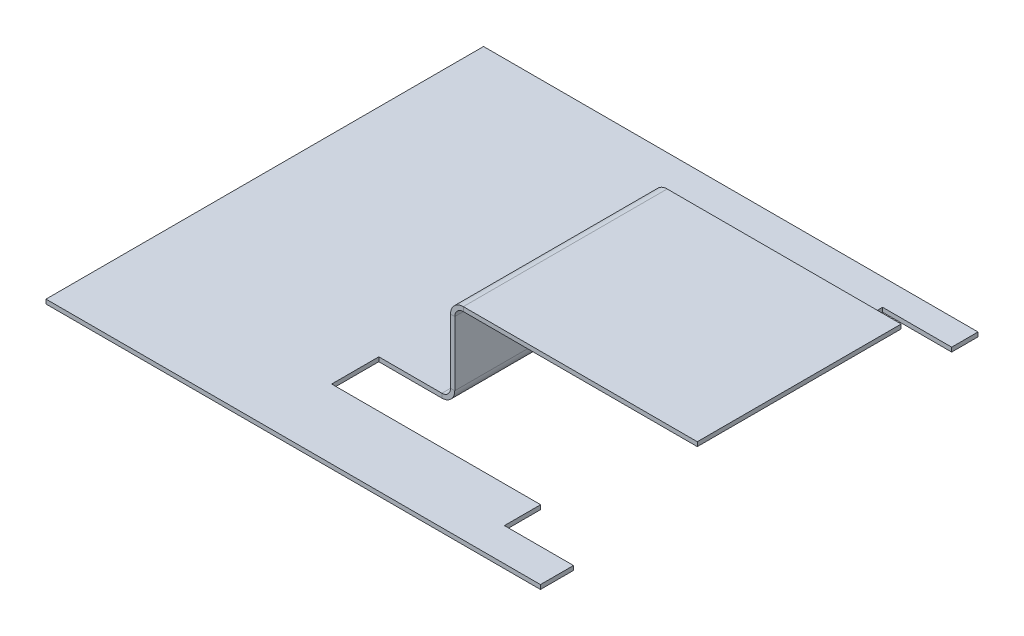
ISO-10303-21;
HEADER;
FILE_DESCRIPTION(('STEP AP214'),'2;1');
FILE_NAME('part.step','',(''),(''),'','','');
FILE_SCHEMA(('AUTOMOTIVE_DESIGN { 1 0 10303 214 1 1 1 1 }'));
ENDSEC;
DATA;
#1=APPLICATION_CONTEXT('core data for automotive mechanical design processes');
#2=APPLICATION_PROTOCOL_DEFINITION('international standard','automotive_design',2000,#1);
#3=PRODUCT_CONTEXT('',#1,'mechanical');
#4=PRODUCT('Part','Part','',(#3));
#5=PRODUCT_RELATED_PRODUCT_CATEGORY('part','',(#4));
#6=PRODUCT_DEFINITION_FORMATION('','',#4);
#7=PRODUCT_DEFINITION_CONTEXT('part definition',#1,'design');
#8=PRODUCT_DEFINITION('design','',#6,#7);
#9=PRODUCT_DEFINITION_SHAPE('','',#8);
#10=(LENGTH_UNIT() NAMED_UNIT(*) SI_UNIT(.MILLI.,.METRE.));
#11=(NAMED_UNIT(*) PLANE_ANGLE_UNIT() SI_UNIT($,.RADIAN.));
#12=(NAMED_UNIT(*) SI_UNIT($,.STERADIAN.) SOLID_ANGLE_UNIT());
#13=UNCERTAINTY_MEASURE_WITH_UNIT(LENGTH_MEASURE(1.E-05),#10,'distance_accuracy_value','');
#14=(GEOMETRIC_REPRESENTATION_CONTEXT(3) GLOBAL_UNCERTAINTY_ASSIGNED_CONTEXT((#13)) GLOBAL_UNIT_ASSIGNED_CONTEXT((#10,
#11,#12)) REPRESENTATION_CONTEXT('',''));
#15=CARTESIAN_POINT('',(0.,0.,0.));
#16=DIRECTION('',(0.,0.,1.));
#17=DIRECTION('',(1.,0.,0.));
#18=AXIS2_PLACEMENT_3D('',#15,#16,#17);
#19=CARTESIAN_POINT('',(57.78914352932,49.2432345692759,41.4697311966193));
#20=DIRECTION('',(1.,0.,0.));
#21=DIRECTION('',(0.,0.,-1.));
#22=AXIS2_PLACEMENT_3D('',#19,#20,#21);
#23=PLANE('',#22);
#24=DIRECTION('',(0.,1.,0.));
#25=VECTOR('',#24,1.);
#26=CARTESIAN_POINT('',(57.7891435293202,-15.6508752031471,22.0110102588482));
#27=LINE('',#26,#25);
#28=CARTESIAN_POINT('',(57.7891435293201,3.,22.0110102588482));
#29=VERTEX_POINT('',#28);
#30=CARTESIAN_POINT('',(57.7891435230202,18.,22.0110102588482));
#31=VERTEX_POINT('',#30);
#32=EDGE_CURVE('E42',#29,#31,#27,.T.);
#33=ORIENTED_EDGE('',*,*,#32,.T.);
#34=DIRECTION('',(0.,0.,-1.));
#35=VECTOR('',#34,1.);
#36=CARTESIAN_POINT('',(57.7891435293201,18.,41.4697311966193));
#37=LINE('',#36,#35);
#38=CARTESIAN_POINT('',(57.7891435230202,18.,-25.5547520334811));
#39=VERTEX_POINT('',#38);
#40=EDGE_CURVE('E397',#31,#39,#37,.T.);
#41=ORIENTED_EDGE('',*,*,#40,.T.);
#42=DIRECTION('',(0.,-1.,0.));
#43=VECTOR('',#42,1.);
#44=CARTESIAN_POINT('',(57.78914352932,58.6719513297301,-25.5547520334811));
#45=LINE('',#44,#43);
#46=CARTESIAN_POINT('',(57.7891435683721,3.,-25.5547520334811));
#47=VERTEX_POINT('',#46);
#48=EDGE_CURVE('E389',#39,#47,#45,.T.);
#49=ORIENTED_EDGE('',*,*,#48,.T.);
#50=DIRECTION('',(0.,0.,-1.));
#51=VECTOR('',#50,1.);
#52=CARTESIAN_POINT('',(57.7891435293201,3.,41.4697311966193));
#53=LINE('',#52,#51);
#54=EDGE_CURVE('E385',#29,#47,#53,.T.);
#55=ORIENTED_EDGE('',*,*,#54,.F.);
#56=EDGE_LOOP('',(#33,#41,#49,#55));
#57=FACE_BOUND('',#56,.T.);
#58=ADVANCED_FACE('F38',(#57),#23,.F.);
#59=CARTESIAN_POINT('',(57.78914352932,58.6719513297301,-25.5547520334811));
#60=DIRECTION('',(0.,0.,1.));
#61=DIRECTION('',(0.,1.,0.));
#62=AXIS2_PLACEMENT_3D('',#59,#60,#61);
#63=PLANE('',#62);
#64=ORIENTED_EDGE('',*,*,#48,.F.);
#65=DIRECTION('',(1.,0.,0.));
#66=VECTOR('',#65,1.);
#67=CARTESIAN_POINT('',(57.7891435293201,18.,-25.5547520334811));
#68=LINE('',#67,#66);
#69=CARTESIAN_POINT('',(58.7891435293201,18.,-25.5547520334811));
#70=VERTEX_POINT('',#69);
#71=EDGE_CURVE('E12',#39,#70,#68,.T.);
#72=ORIENTED_EDGE('',*,*,#71,.T.);
#73=DIRECTION('',(0.,-1.,0.));
#74=VECTOR('',#73,1.);
#75=CARTESIAN_POINT('',(58.7891435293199,58.6719513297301,-25.5547520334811));
#76=LINE('',#75,#74);
#77=CARTESIAN_POINT('',(58.7891435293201,3.00000000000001,-25.5547520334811));
#78=VERTEX_POINT('',#77);
#79=EDGE_CURVE('E404',#70,#78,#76,.T.);
#80=ORIENTED_EDGE('',*,*,#79,.T.);
#81=DIRECTION('',(1.,0.,0.));
#82=VECTOR('',#81,1.);
#83=CARTESIAN_POINT('',(57.7891435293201,3.,-25.5547520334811));
#84=LINE('',#83,#82);
#85=EDGE_CURVE('E388',#47,#78,#84,.T.);
#86=ORIENTED_EDGE('',*,*,#85,.F.);
#87=EDGE_LOOP('',(#64,#72,#80,#86));
#88=FACE_BOUND('',#87,.T.);
#89=ADVANCED_FACE('F40',(#88),#63,.F.);
#90=CARTESIAN_POINT('',(57.7891435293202,-15.6508752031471,22.0110102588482));
#91=DIRECTION('',(0.,0.,-1.));
#92=DIRECTION('',(0.,-1.,0.));
#93=AXIS2_PLACEMENT_3D('',#90,#91,#92);
#94=PLANE('',#93);
#95=DIRECTION('',(0.,1.,0.));
#96=VECTOR('',#95,1.);
#97=CARTESIAN_POINT('',(58.7891435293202,-15.6508752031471,22.0110102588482));
#98=LINE('',#97,#96);
#99=CARTESIAN_POINT('',(58.7891435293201,3.00000000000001,22.0110102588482));
#100=VERTEX_POINT('',#99);
#101=CARTESIAN_POINT('',(58.7891435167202,18.,22.0110102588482));
#102=VERTEX_POINT('',#101);
#103=EDGE_CURVE('E61',#100,#102,#98,.T.);
#104=ORIENTED_EDGE('',*,*,#103,.T.);
#105=DIRECTION('',(-1.,0.,0.));
#106=VECTOR('',#105,1.);
#107=CARTESIAN_POINT('',(57.7891435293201,18.,22.0110102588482));
#108=LINE('',#107,#106);
#109=EDGE_CURVE('E400',#102,#31,#108,.T.);
#110=ORIENTED_EDGE('',*,*,#109,.T.);
#111=ORIENTED_EDGE('',*,*,#32,.F.);
#112=DIRECTION('',(-1.,0.,0.));
#113=VECTOR('',#112,1.);
#114=CARTESIAN_POINT('',(57.7891435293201,3.,22.0110102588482));
#115=LINE('',#114,#113);
#116=EDGE_CURVE('E394',#100,#29,#115,.T.);
#117=ORIENTED_EDGE('',*,*,#116,.F.);
#118=EDGE_LOOP('',(#104,#110,#111,#117));
#119=FACE_BOUND('',#118,.T.);
#120=ADVANCED_FACE('F413',(#119),#94,.F.);
#121=CARTESIAN_POINT('',(58.78914352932,49.2432345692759,41.4697311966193));
#122=DIRECTION('',(1.,0.,0.));
#123=DIRECTION('',(0.,0.,-1.));
#124=AXIS2_PLACEMENT_3D('',#121,#122,#123);
#125=PLANE('',#124);
#126=DIRECTION('',(0.,0.,-1.));
#127=VECTOR('',#126,1.);
#128=CARTESIAN_POINT('',(58.7891435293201,18.,41.4697311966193));
#129=LINE('',#128,#127);
#130=EDGE_CURVE('E47',#102,#70,#129,.T.);
#131=ORIENTED_EDGE('',*,*,#130,.F.);
#132=ORIENTED_EDGE('',*,*,#103,.F.);
#133=DIRECTION('',(0.,0.,-1.));
#134=VECTOR('',#133,1.);
#135=CARTESIAN_POINT('',(58.7891435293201,3.,41.4697311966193));
#136=LINE('',#135,#134);
#137=EDGE_CURVE('E392',#100,#78,#136,.T.);
#138=ORIENTED_EDGE('',*,*,#137,.T.);
#139=ORIENTED_EDGE('',*,*,#79,.F.);
#140=EDGE_LOOP('',(#131,#132,#138,#139));
#141=FACE_BOUND('',#140,.T.);
#142=ADVANCED_FACE('F448',(#141),#125,.T.);
#143=CARTESIAN_POINT('',(41.0652591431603,1.,33.0179635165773));
#144=DIRECTION('',(-1.,0.,0.));
#145=DIRECTION('',(0.,0.,1.));
#146=AXIS2_PLACEMENT_3D('',#143,#144,#145);
#147=PLANE('',#146);
#148=DIRECTION('',(0.,0.,-1.));
#149=VECTOR('',#148,1.);
#150=CARTESIAN_POINT('',(41.0652591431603,0.,33.0179635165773));
#151=LINE('',#150,#149);
#152=CARTESIAN_POINT('',(41.0652591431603,0.,33.0179635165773));
#153=VERTEX_POINT('',#152);
#154=CARTESIAN_POINT('',(41.0652591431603,0.,22.0110102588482));
#155=VERTEX_POINT('',#154);
#156=EDGE_CURVE('E382',#153,#155,#151,.T.);
#157=ORIENTED_EDGE('',*,*,#156,.T.);
#158=DIRECTION('',(0.,-1.,0.));
#159=VECTOR('',#158,1.);
#160=CARTESIAN_POINT('',(41.0652591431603,1.,22.0110102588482));
#161=LINE('',#160,#159);
#162=CARTESIAN_POINT('',(41.0652591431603,1.,22.0110102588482));
#163=VERTEX_POINT('',#162);
#164=EDGE_CURVE('E269',#163,#155,#161,.T.);
#165=ORIENTED_EDGE('',*,*,#164,.F.);
#166=DIRECTION('',(0.,0.,-1.));
#167=VECTOR('',#166,1.);
#168=CARTESIAN_POINT('',(41.0652591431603,1.,33.0179635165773));
#169=LINE('',#168,#167);
#170=CARTESIAN_POINT('',(41.0652591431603,1.,33.0179635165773));
#171=VERTEX_POINT('',#170);
#172=EDGE_CURVE('E283',#171,#163,#169,.T.);
#173=ORIENTED_EDGE('',*,*,#172,.F.);
#174=DIRECTION('',(0.,-1.,0.));
#175=VECTOR('',#174,1.);
#176=CARTESIAN_POINT('',(41.0652591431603,1.,33.0179635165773));
#177=LINE('',#176,#175);
#178=EDGE_CURVE('E379',#171,#153,#177,.T.);
#179=ORIENTED_EDGE('',*,*,#178,.T.);
#180=EDGE_LOOP('',(#157,#165,#173,#179));
#181=FACE_BOUND('',#180,.T.);
#182=ADVANCED_FACE('F450',(#181),#147,.F.);
#183=CARTESIAN_POINT('',(89.8362298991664,1.,33.0179635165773));
#184=DIRECTION('',(0.,0.,1.));
#185=DIRECTION('',(1.,0.,0.));
#186=AXIS2_PLACEMENT_3D('',#183,#184,#185);
#187=PLANE('',#186);
#188=DIRECTION('',(-1.,0.,0.));
#189=VECTOR('',#188,1.);
#190=CARTESIAN_POINT('',(89.8362298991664,0.,33.0179635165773));
#191=LINE('',#190,#189);
#192=CARTESIAN_POINT('',(89.8362298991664,0.,33.0179635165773));
#193=VERTEX_POINT('',#192);
#194=EDGE_CURVE('E377',#193,#153,#191,.T.);
#195=ORIENTED_EDGE('',*,*,#194,.T.);
#196=ORIENTED_EDGE('',*,*,#178,.F.);
#197=DIRECTION('',(-1.,0.,0.));
#198=VECTOR('',#197,1.);
#199=CARTESIAN_POINT('',(89.8362298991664,1.,33.0179635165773));
#200=LINE('',#199,#198);
#201=CARTESIAN_POINT('',(89.8362298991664,1.,33.0179635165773));
#202=VERTEX_POINT('',#201);
#203=EDGE_CURVE('E285',#202,#171,#200,.T.);
#204=ORIENTED_EDGE('',*,*,#203,.F.);
#205=DIRECTION('',(0.,-1.,0.));
#206=VECTOR('',#205,1.);
#207=CARTESIAN_POINT('',(89.8362298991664,1.,33.0179635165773));
#208=LINE('',#207,#206);
#209=EDGE_CURVE('E374',#202,#193,#208,.T.);
#210=ORIENTED_EDGE('',*,*,#209,.T.);
#211=EDGE_LOOP('',(#195,#196,#204,#210));
#212=FACE_BOUND('',#211,.T.);
#213=ADVANCED_FACE('F454',(#212),#187,.F.);
#214=CARTESIAN_POINT('',(89.8362298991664,1.,33.0179635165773));
#215=DIRECTION('',(-1.,0.,0.));
#216=DIRECTION('',(0.,0.,1.));
#217=AXIS2_PLACEMENT_3D('',#214,#215,#216);
#218=PLANE('',#217);
#219=DIRECTION('',(0.,0.,-1.));
#220=VECTOR('',#219,1.);
#221=CARTESIAN_POINT('',(89.8362298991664,0.,33.0179635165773));
#222=LINE('',#221,#220);
#223=CARTESIAN_POINT('',(89.8362298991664,0.,41.4697311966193));
#224=VERTEX_POINT('',#223);
#225=EDGE_CURVE('E372',#224,#193,#222,.T.);
#226=ORIENTED_EDGE('',*,*,#225,.T.);
#227=ORIENTED_EDGE('',*,*,#209,.F.);
#228=DIRECTION('',(0.,0.,-1.));
#229=VECTOR('',#228,1.);
#230=CARTESIAN_POINT('',(89.8362298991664,1.,33.0179635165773));
#231=LINE('',#230,#229);
#232=CARTESIAN_POINT('',(89.8362298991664,1.,41.4697311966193));
#233=VERTEX_POINT('',#232);
#234=EDGE_CURVE('E287',#233,#202,#231,.T.);
#235=ORIENTED_EDGE('',*,*,#234,.F.);
#236=DIRECTION('',(0.,-1.,0.));
#237=VECTOR('',#236,1.);
#238=CARTESIAN_POINT('',(89.8362298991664,1.,41.4697311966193));
#239=LINE('',#238,#237);
#240=EDGE_CURVE('E369',#233,#224,#239,.T.);
#241=ORIENTED_EDGE('',*,*,#240,.T.);
#242=EDGE_LOOP('',(#226,#227,#235,#241));
#243=FACE_BOUND('',#242,.T.);
#244=ADVANCED_FACE('F499',(#243),#218,.F.);
#245=CARTESIAN_POINT('',(89.8362298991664,1.,41.4697311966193));
#246=DIRECTION('',(0.,0.,1.));
#247=DIRECTION('',(1.,0.,0.));
#248=AXIS2_PLACEMENT_3D('',#245,#246,#247);
#249=PLANE('',#248);
#250=DIRECTION('',(-1.,0.,0.));
#251=VECTOR('',#250,1.);
#252=CARTESIAN_POINT('',(89.8362298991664,0.,41.4697311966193));
#253=LINE('',#252,#251);
#254=CARTESIAN_POINT('',(105.959368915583,0.,41.4697311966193));
#255=VERTEX_POINT('',#254);
#256=EDGE_CURVE('E367',#255,#224,#253,.T.);
#257=ORIENTED_EDGE('',*,*,#256,.T.);
#258=ORIENTED_EDGE('',*,*,#240,.F.);
#259=DIRECTION('',(-1.,0.,0.));
#260=VECTOR('',#259,1.);
#261=CARTESIAN_POINT('',(89.8362298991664,1.,41.4697311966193));
#262=LINE('',#261,#260);
#263=CARTESIAN_POINT('',(105.959368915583,1.,41.4697311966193));
#264=VERTEX_POINT('',#263);
#265=EDGE_CURVE('E289',#264,#233,#262,.T.);
#266=ORIENTED_EDGE('',*,*,#265,.F.);
#267=DIRECTION('',(0.,-1.,0.));
#268=VECTOR('',#267,1.);
#269=CARTESIAN_POINT('',(105.959368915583,1.,41.4697311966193));
#270=LINE('',#269,#268);
#271=EDGE_CURVE('E364',#264,#255,#270,.T.);
#272=ORIENTED_EDGE('',*,*,#271,.T.);
#273=EDGE_LOOP('',(#257,#258,#266,#272));
#274=FACE_BOUND('',#273,.T.);
#275=ADVANCED_FACE('F503',(#274),#249,.F.);
#276=CARTESIAN_POINT('',(105.959368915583,1.,49.1848728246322));
#277=DIRECTION('',(-1.,0.,0.));
#278=DIRECTION('',(0.,0.,1.));
#279=AXIS2_PLACEMENT_3D('',#276,#277,#278);
#280=PLANE('',#279);
#281=DIRECTION('',(0.,0.,-1.));
#282=VECTOR('',#281,1.);
#283=CARTESIAN_POINT('',(105.959368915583,0.,49.1848728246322));
#284=LINE('',#283,#282);
#285=CARTESIAN_POINT('',(105.959368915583,0.,49.1848728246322));
#286=VERTEX_POINT('',#285);
#287=EDGE_CURVE('E361',#286,#255,#284,.T.);
#288=ORIENTED_EDGE('',*,*,#287,.T.);
#289=ORIENTED_EDGE('',*,*,#271,.F.);
#290=DIRECTION('',(0.,0.,-1.));
#291=VECTOR('',#290,1.);
#292=CARTESIAN_POINT('',(105.959368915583,1.,49.1848728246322));
#293=LINE('',#292,#291);
#294=CARTESIAN_POINT('',(105.959368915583,1.,49.1848728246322));
#295=VERTEX_POINT('',#294);
#296=EDGE_CURVE('E291',#295,#264,#293,.T.);
#297=ORIENTED_EDGE('',*,*,#296,.F.);
#298=DIRECTION('',(0.,-1.,0.));
#299=VECTOR('',#298,1.);
#300=CARTESIAN_POINT('',(105.959368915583,1.,49.1848728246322));
#301=LINE('',#300,#299);
#302=EDGE_CURVE('E358',#295,#286,#301,.T.);
#303=ORIENTED_EDGE('',*,*,#302,.T.);
#304=EDGE_LOOP('',(#288,#289,#297,#303));
#305=FACE_BOUND('',#304,.T.);
#306=ADVANCED_FACE('F507',(#305),#280,.F.);
#307=CARTESIAN_POINT('',(105.959368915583,1.,49.1848728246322));
#308=DIRECTION('',(0.,0.,-1.));
#309=DIRECTION('',(-1.,0.,0.));
#310=AXIS2_PLACEMENT_3D('',#307,#308,#309);
#311=PLANE('',#310);
#312=DIRECTION('',(1.,0.,0.));
#313=VECTOR('',#312,1.);
#314=CARTESIAN_POINT('',(105.959368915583,0.,49.1848728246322));
#315=LINE('',#314,#313);
#316=CARTESIAN_POINT('',(-9.4287167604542,0.,49.1848728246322));
#317=VERTEX_POINT('',#316);
#318=EDGE_CURVE('E356',#317,#286,#315,.T.);
#319=ORIENTED_EDGE('',*,*,#318,.T.);
#320=ORIENTED_EDGE('',*,*,#302,.F.);
#321=DIRECTION('',(1.,0.,0.));
#322=VECTOR('',#321,1.);
#323=CARTESIAN_POINT('',(105.959368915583,1.,49.1848728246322));
#324=LINE('',#323,#322);
#325=CARTESIAN_POINT('',(-9.4287167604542,1.,49.1848728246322));
#326=VERTEX_POINT('',#325);
#327=EDGE_CURVE('E294',#326,#295,#324,.T.);
#328=ORIENTED_EDGE('',*,*,#327,.F.);
#329=DIRECTION('',(0.,-1.,0.));
#330=VECTOR('',#329,1.);
#331=CARTESIAN_POINT('',(-9.4287167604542,1.,49.1848728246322));
#332=LINE('',#331,#330);
#333=EDGE_CURVE('E353',#326,#317,#332,.T.);
#334=ORIENTED_EDGE('',*,*,#333,.T.);
#335=EDGE_LOOP('',(#319,#320,#328,#334));
#336=FACE_BOUND('',#335,.T.);
#337=ADVANCED_FACE('F511',(#336),#311,.F.);
#338=CARTESIAN_POINT('',(-9.4287167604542,1.,49.1848728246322));
#339=DIRECTION('',(1.,0.,0.));
#340=DIRECTION('',(0.,0.,-1.));
#341=AXIS2_PLACEMENT_3D('',#338,#339,#340);
#342=PLANE('',#341);
#343=DIRECTION('',(0.,0.,1.));
#344=VECTOR('',#343,1.);
#345=CARTESIAN_POINT('',(-9.4287167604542,0.,49.1848728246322));
#346=LINE('',#345,#344);
#347=CARTESIAN_POINT('',(-9.4287167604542,0.,-52.9251673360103));
#348=VERTEX_POINT('',#347);
#349=EDGE_CURVE('E351',#348,#317,#346,.T.);
#350=ORIENTED_EDGE('',*,*,#349,.T.);
#351=ORIENTED_EDGE('',*,*,#333,.F.);
#352=DIRECTION('',(0.,0.,1.));
#353=VECTOR('',#352,1.);
#354=CARTESIAN_POINT('',(-9.4287167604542,1.,49.1848728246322));
#355=LINE('',#354,#353);
#356=CARTESIAN_POINT('',(-9.4287167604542,1.,-52.9251673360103));
#357=VERTEX_POINT('',#356);
#358=EDGE_CURVE('E296',#357,#326,#355,.T.);
#359=ORIENTED_EDGE('',*,*,#358,.F.);
#360=DIRECTION('',(0.,-1.,0.));
#361=VECTOR('',#360,1.);
#362=CARTESIAN_POINT('',(-9.4287167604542,1.,-52.9251673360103));
#363=LINE('',#362,#361);
#364=EDGE_CURVE('E348',#357,#348,#363,.T.);
#365=ORIENTED_EDGE('',*,*,#364,.T.);
#366=EDGE_LOOP('',(#350,#351,#359,#365));
#367=FACE_BOUND('',#366,.T.);
#368=ADVANCED_FACE('F515',(#367),#342,.F.);
#369=CARTESIAN_POINT('',(105.959368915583,1.,-52.9251673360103));
#370=DIRECTION('',(0.,0.,1.));
#371=DIRECTION('',(1.,0.,0.));
#372=AXIS2_PLACEMENT_3D('',#369,#370,#371);
#373=PLANE('',#372);
#374=DIRECTION('',(-1.,0.,0.));
#375=VECTOR('',#374,1.);
#376=CARTESIAN_POINT('',(105.959368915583,0.,-52.9251673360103));
#377=LINE('',#376,#375);
#378=CARTESIAN_POINT('',(105.959368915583,0.,-52.9251673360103));
#379=VERTEX_POINT('',#378);
#380=EDGE_CURVE('E346',#379,#348,#377,.T.);
#381=ORIENTED_EDGE('',*,*,#380,.T.);
#382=ORIENTED_EDGE('',*,*,#364,.F.);
#383=DIRECTION('',(-1.,0.,0.));
#384=VECTOR('',#383,1.);
#385=CARTESIAN_POINT('',(105.959368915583,1.,-52.9251673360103));
#386=LINE('',#385,#384);
#387=CARTESIAN_POINT('',(105.959368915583,1.,-52.9251673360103));
#388=VERTEX_POINT('',#387);
#389=EDGE_CURVE('E298',#388,#357,#386,.T.);
#390=ORIENTED_EDGE('',*,*,#389,.F.);
#391=DIRECTION('',(0.,-1.,0.));
#392=VECTOR('',#391,1.);
#393=CARTESIAN_POINT('',(105.959368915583,1.,-52.9251673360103));
#394=LINE('',#393,#392);
#395=EDGE_CURVE('E343',#388,#379,#394,.T.);
#396=ORIENTED_EDGE('',*,*,#395,.T.);
#397=EDGE_LOOP('',(#381,#382,#390,#396));
#398=FACE_BOUND('',#397,.T.);
#399=ADVANCED_FACE('F519',(#398),#373,.F.);
#400=CARTESIAN_POINT('',(105.959368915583,1.,-46.7824476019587));
#401=DIRECTION('',(-1.,0.,0.));
#402=DIRECTION('',(0.,0.,1.));
#403=AXIS2_PLACEMENT_3D('',#400,#401,#402);
#404=PLANE('',#403);
#405=DIRECTION('',(0.,0.,-1.));
#406=VECTOR('',#405,1.);
#407=CARTESIAN_POINT('',(105.959368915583,0.,-46.7824476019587));
#408=LINE('',#407,#406);
#409=CARTESIAN_POINT('',(105.959368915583,0.,-46.7824476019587));
#410=VERTEX_POINT('',#409);
#411=EDGE_CURVE('E341',#410,#379,#408,.T.);
#412=ORIENTED_EDGE('',*,*,#411,.T.);
#413=ORIENTED_EDGE('',*,*,#395,.F.);
#414=DIRECTION('',(0.,0.,-1.));
#415=VECTOR('',#414,1.);
#416=CARTESIAN_POINT('',(105.959368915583,1.,-46.7824476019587));
#417=LINE('',#416,#415);
#418=CARTESIAN_POINT('',(105.959368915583,1.,-46.7824476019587));
#419=VERTEX_POINT('',#418);
#420=EDGE_CURVE('E300',#419,#388,#417,.T.);
#421=ORIENTED_EDGE('',*,*,#420,.F.);
#422=DIRECTION('',(0.,-1.,0.));
#423=VECTOR('',#422,1.);
#424=CARTESIAN_POINT('',(105.959368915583,1.,-46.7824476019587));
#425=LINE('',#424,#423);
#426=EDGE_CURVE('E338',#419,#410,#425,.T.);
#427=ORIENTED_EDGE('',*,*,#426,.T.);
#428=EDGE_LOOP('',(#412,#413,#421,#427));
#429=FACE_BOUND('',#428,.T.);
#430=ADVANCED_FACE('F523',(#429),#404,.F.);
#431=CARTESIAN_POINT('',(89.8362298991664,1.,-46.7824476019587));
#432=DIRECTION('',(0.,0.,-1.));
#433=DIRECTION('',(-1.,0.,0.));
#434=AXIS2_PLACEMENT_3D('',#431,#432,#433);
#435=PLANE('',#434);
#436=DIRECTION('',(1.,0.,0.));
#437=VECTOR('',#436,1.);
#438=CARTESIAN_POINT('',(89.8362298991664,0.,-46.7824476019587));
#439=LINE('',#438,#437);
#440=CARTESIAN_POINT('',(89.8362298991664,0.,-46.7824476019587));
#441=VERTEX_POINT('',#440);
#442=EDGE_CURVE('E336',#441,#410,#439,.T.);
#443=ORIENTED_EDGE('',*,*,#442,.T.);
#444=ORIENTED_EDGE('',*,*,#426,.F.);
#445=DIRECTION('',(1.,0.,0.));
#446=VECTOR('',#445,1.);
#447=CARTESIAN_POINT('',(89.8362298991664,1.,-46.7824476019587));
#448=LINE('',#447,#446);
#449=CARTESIAN_POINT('',(89.8362298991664,1.,-46.7824476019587));
#450=VERTEX_POINT('',#449);
#451=EDGE_CURVE('E302',#450,#419,#448,.T.);
#452=ORIENTED_EDGE('',*,*,#451,.F.);
#453=DIRECTION('',(0.,-1.,0.));
#454=VECTOR('',#453,1.);
#455=CARTESIAN_POINT('',(89.8362298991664,1.,-46.7824476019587));
#456=LINE('',#455,#454);
#457=EDGE_CURVE('E333',#450,#441,#456,.T.);
#458=ORIENTED_EDGE('',*,*,#457,.T.);
#459=EDGE_LOOP('',(#443,#444,#452,#458));
#460=FACE_BOUND('',#459,.T.);
#461=ADVANCED_FACE('F527',(#460),#435,.F.);
#462=CARTESIAN_POINT('',(89.8362298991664,1.,-35.7754943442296));
#463=DIRECTION('',(-1.,0.,0.));
#464=DIRECTION('',(0.,0.,1.));
#465=AXIS2_PLACEMENT_3D('',#462,#463,#464);
#466=PLANE('',#465);
#467=DIRECTION('',(0.,0.,-1.));
#468=VECTOR('',#467,1.);
#469=CARTESIAN_POINT('',(89.8362298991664,0.,-35.7754943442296));
#470=LINE('',#469,#468);
#471=CARTESIAN_POINT('',(89.8362298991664,0.,-35.7754943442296));
#472=VERTEX_POINT('',#471);
#473=EDGE_CURVE('E331',#472,#441,#470,.T.);
#474=ORIENTED_EDGE('',*,*,#473,.T.);
#475=ORIENTED_EDGE('',*,*,#457,.F.);
#476=DIRECTION('',(0.,0.,-1.));
#477=VECTOR('',#476,1.);
#478=CARTESIAN_POINT('',(89.8362298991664,1.,-35.7754943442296));
#479=LINE('',#478,#477);
#480=CARTESIAN_POINT('',(89.8362298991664,1.,-35.7754943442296));
#481=VERTEX_POINT('',#480);
#482=EDGE_CURVE('E304',#481,#450,#479,.T.);
#483=ORIENTED_EDGE('',*,*,#482,.F.);
#484=DIRECTION('',(0.,-1.,0.));
#485=VECTOR('',#484,1.);
#486=CARTESIAN_POINT('',(89.8362298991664,1.,-35.7754943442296));
#487=LINE('',#486,#485);
#488=EDGE_CURVE('E328',#481,#472,#487,.T.);
#489=ORIENTED_EDGE('',*,*,#488,.T.);
#490=EDGE_LOOP('',(#474,#475,#483,#489));
#491=FACE_BOUND('',#490,.T.);
#492=ADVANCED_FACE('F531',(#491),#466,.F.);
#493=CARTESIAN_POINT('',(41.0652591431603,1.,-35.7754943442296));
#494=DIRECTION('',(0.,0.,-1.));
#495=DIRECTION('',(-1.,0.,0.));
#496=AXIS2_PLACEMENT_3D('',#493,#494,#495);
#497=PLANE('',#496);
#498=DIRECTION('',(1.,0.,0.));
#499=VECTOR('',#498,1.);
#500=CARTESIAN_POINT('',(41.0652591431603,0.,-35.7754943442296));
#501=LINE('',#500,#499);
#502=CARTESIAN_POINT('',(41.0652591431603,0.,-35.7754943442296));
#503=VERTEX_POINT('',#502);
#504=EDGE_CURVE('E326',#503,#472,#501,.T.);
#505=ORIENTED_EDGE('',*,*,#504,.T.);
#506=ORIENTED_EDGE('',*,*,#488,.F.);
#507=DIRECTION('',(1.,0.,0.));
#508=VECTOR('',#507,1.);
#509=CARTESIAN_POINT('',(41.0652591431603,1.,-35.7754943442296));
#510=LINE('',#509,#508);
#511=CARTESIAN_POINT('',(41.0652591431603,1.,-35.7754943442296));
#512=VERTEX_POINT('',#511);
#513=EDGE_CURVE('E306',#512,#481,#510,.T.);
#514=ORIENTED_EDGE('',*,*,#513,.F.);
#515=DIRECTION('',(0.,-1.,0.));
#516=VECTOR('',#515,1.);
#517=CARTESIAN_POINT('',(41.0652591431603,1.,-35.7754943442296));
#518=LINE('',#517,#516);
#519=EDGE_CURVE('E323',#512,#503,#518,.T.);
#520=ORIENTED_EDGE('',*,*,#519,.T.);
#521=EDGE_LOOP('',(#505,#506,#514,#520));
#522=FACE_BOUND('',#521,.T.);
#523=ADVANCED_FACE('F535',(#522),#497,.F.);
#524=CARTESIAN_POINT('',(41.0652591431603,1.,-25.5547520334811));
#525=DIRECTION('',(-1.,0.,0.));
#526=DIRECTION('',(0.,0.,1.));
#527=AXIS2_PLACEMENT_3D('',#524,#525,#526);
#528=PLANE('',#527);
#529=DIRECTION('',(0.,0.,-1.));
#530=VECTOR('',#529,1.);
#531=CARTESIAN_POINT('',(41.0652591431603,0.,-25.5547520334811));
#532=LINE('',#531,#530);
#533=CARTESIAN_POINT('',(41.0652591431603,0.,-25.5547520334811));
#534=VERTEX_POINT('',#533);
#535=EDGE_CURVE('E321',#534,#503,#532,.T.);
#536=ORIENTED_EDGE('',*,*,#535,.T.);
#537=ORIENTED_EDGE('',*,*,#519,.F.);
#538=DIRECTION('',(0.,0.,-1.));
#539=VECTOR('',#538,1.);
#540=CARTESIAN_POINT('',(41.0652591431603,1.,-25.5547520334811));
#541=LINE('',#540,#539);
#542=CARTESIAN_POINT('',(41.0652591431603,1.,-25.5547520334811));
#543=VERTEX_POINT('',#542);
#544=EDGE_CURVE('E308',#543,#512,#541,.T.);
#545=ORIENTED_EDGE('',*,*,#544,.F.);
#546=DIRECTION('',(0.,-1.,0.));
#547=VECTOR('',#546,1.);
#548=CARTESIAN_POINT('',(41.0652591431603,1.,-25.5547520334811));
#549=LINE('',#548,#547);
#550=EDGE_CURVE('E318',#543,#534,#549,.T.);
#551=ORIENTED_EDGE('',*,*,#550,.T.);
#552=EDGE_LOOP('',(#536,#537,#545,#551));
#553=FACE_BOUND('',#552,.T.);
#554=ADVANCED_FACE('F539',(#553),#528,.F.);
#555=CARTESIAN_POINT('',(105.959368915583,1.,41.4697311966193));
#556=DIRECTION('',(0.,-1.,0.));
#557=DIRECTION('',(0.,0.,-1.));
#558=AXIS2_PLACEMENT_3D('',#555,#556,#557);
#559=PLANE('',#558);
#560=DIRECTION('',(1.,0.,0.));
#561=VECTOR('',#560,1.);
#562=CARTESIAN_POINT('',(41.0652591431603,1.,22.0110102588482));
#563=LINE('',#562,#561);
#564=CARTESIAN_POINT('',(55.7891435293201,0.999999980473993,22.0110102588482));
#565=VERTEX_POINT('',#564);
#566=EDGE_CURVE('E315',#163,#565,#563,.T.);
#567=ORIENTED_EDGE('',*,*,#566,.T.);
#568=DIRECTION('',(0.,0.,-1.));
#569=VECTOR('',#568,1.);
#570=CARTESIAN_POINT('',(55.7891435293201,1.,41.4697311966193));
#571=LINE('',#570,#569);
#572=CARTESIAN_POINT('',(55.7891435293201,0.999999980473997,-25.5547520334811));
#573=VERTEX_POINT('',#572);
#574=EDGE_CURVE('E312',#565,#573,#571,.T.);
#575=ORIENTED_EDGE('',*,*,#574,.T.);
#576=DIRECTION('',(-1.,0.,0.));
#577=VECTOR('',#576,1.);
#578=CARTESIAN_POINT('',(115.388085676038,1.,-25.5547520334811));
#579=LINE('',#578,#577);
#580=EDGE_CURVE('E310',#573,#543,#579,.T.);
#581=ORIENTED_EDGE('',*,*,#580,.T.);
#582=ORIENTED_EDGE('',*,*,#544,.T.);
#583=ORIENTED_EDGE('',*,*,#513,.T.);
#584=ORIENTED_EDGE('',*,*,#482,.T.);
#585=ORIENTED_EDGE('',*,*,#451,.T.);
#586=ORIENTED_EDGE('',*,*,#420,.T.);
#587=ORIENTED_EDGE('',*,*,#389,.T.);
#588=ORIENTED_EDGE('',*,*,#358,.T.);
#589=ORIENTED_EDGE('',*,*,#327,.T.);
#590=ORIENTED_EDGE('',*,*,#296,.T.);
#591=ORIENTED_EDGE('',*,*,#265,.T.);
#592=ORIENTED_EDGE('',*,*,#234,.T.);
#593=ORIENTED_EDGE('',*,*,#203,.T.);
#594=ORIENTED_EDGE('',*,*,#172,.T.);
#595=EDGE_LOOP('',(#567,#575,#581,#582,#583,#584,#585,#586,#587,#588,#589,#590,#591,#592,#593,#594));
#596=FACE_BOUND('',#595,.T.);
#597=ADVANCED_FACE('F481',(#596),#559,.F.);
#598=CARTESIAN_POINT('',(115.388085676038,1.,-25.5547520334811));
#599=DIRECTION('',(0.,0.,1.));
#600=DIRECTION('',(1.,0.,0.));
#601=AXIS2_PLACEMENT_3D('',#598,#599,#600);
#602=PLANE('',#601);
#603=ORIENTED_EDGE('',*,*,#580,.F.);
#604=DIRECTION('',(0.,-1.,0.));
#605=VECTOR('',#604,1.);
#606=CARTESIAN_POINT('',(55.7891435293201,1.,-25.5547520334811));
#607=LINE('',#606,#605);
#608=CARTESIAN_POINT('',(55.7891435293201,0.,-25.5547520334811));
#609=VERTEX_POINT('',#608);
#610=EDGE_CURVE('E280',#573,#609,#607,.T.);
#611=ORIENTED_EDGE('',*,*,#610,.T.);
#612=DIRECTION('',(-1.,0.,0.));
#613=VECTOR('',#612,1.);
#614=CARTESIAN_POINT('',(115.388085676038,0.,-25.5547520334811));
#615=LINE('',#614,#613);
#616=EDGE_CURVE('E278',#609,#534,#615,.T.);
#617=ORIENTED_EDGE('',*,*,#616,.T.);
#618=ORIENTED_EDGE('',*,*,#550,.F.);
#619=EDGE_LOOP('',(#603,#611,#617,#618));
#620=FACE_BOUND('',#619,.T.);
#621=ADVANCED_FACE('F476',(#620),#602,.F.);
#622=CARTESIAN_POINT('',(105.959368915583,0.,41.4697311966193));
#623=DIRECTION('',(0.,-1.,0.));
#624=DIRECTION('',(0.,0.,-1.));
#625=AXIS2_PLACEMENT_3D('',#622,#623,#624);
#626=PLANE('',#625);
#627=DIRECTION('',(0.,0.,-1.));
#628=VECTOR('',#627,1.);
#629=CARTESIAN_POINT('',(55.7891435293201,0.,41.4697311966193));
#630=LINE('',#629,#628);
#631=CARTESIAN_POINT('',(55.7891435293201,-3.90520124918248E-08,22.0110102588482));
#632=VERTEX_POINT('',#631);
#633=EDGE_CURVE('E264',#632,#609,#630,.T.);
#634=ORIENTED_EDGE('',*,*,#633,.F.);
#635=DIRECTION('',(1.,0.,0.));
#636=VECTOR('',#635,1.);
#637=CARTESIAN_POINT('',(41.0652591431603,0.,22.0110102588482));
#638=LINE('',#637,#636);
#639=EDGE_CURVE('E275',#155,#632,#638,.T.);
#640=ORIENTED_EDGE('',*,*,#639,.F.);
#641=ORIENTED_EDGE('',*,*,#156,.F.);
#642=ORIENTED_EDGE('',*,*,#194,.F.);
#643=ORIENTED_EDGE('',*,*,#225,.F.);
#644=ORIENTED_EDGE('',*,*,#256,.F.);
#645=ORIENTED_EDGE('',*,*,#287,.F.);
#646=ORIENTED_EDGE('',*,*,#318,.F.);
#647=ORIENTED_EDGE('',*,*,#349,.F.);
#648=ORIENTED_EDGE('',*,*,#380,.F.);
#649=ORIENTED_EDGE('',*,*,#411,.F.);
#650=ORIENTED_EDGE('',*,*,#442,.F.);
#651=ORIENTED_EDGE('',*,*,#473,.F.);
#652=ORIENTED_EDGE('',*,*,#504,.F.);
#653=ORIENTED_EDGE('',*,*,#535,.F.);
#654=ORIENTED_EDGE('',*,*,#616,.F.);
#655=EDGE_LOOP('',(#634,#640,#641,#642,#643,#644,#645,#646,#647,#648,#649,#650,#651,#652,#653,#654));
#656=FACE_BOUND('',#655,.T.);
#657=ADVANCED_FACE('F469',(#656),#626,.T.);
#658=CARTESIAN_POINT('',(41.0652591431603,1.,22.0110102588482));
#659=DIRECTION('',(0.,0.,-1.));
#660=DIRECTION('',(-1.,0.,0.));
#661=AXIS2_PLACEMENT_3D('',#658,#659,#660);
#662=PLANE('',#661);
#663=ORIENTED_EDGE('',*,*,#639,.T.);
#664=DIRECTION('',(0.,1.,0.));
#665=VECTOR('',#664,1.);
#666=CARTESIAN_POINT('',(55.7891435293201,1.,22.0110102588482));
#667=LINE('',#666,#665);
#668=EDGE_CURVE('E272',#632,#565,#667,.T.);
#669=ORIENTED_EDGE('',*,*,#668,.T.);
#670=ORIENTED_EDGE('',*,*,#566,.F.);
#671=ORIENTED_EDGE('',*,*,#164,.T.);
#672=EDGE_LOOP('',(#663,#669,#670,#671));
#673=FACE_BOUND('',#672,.T.);
#674=ADVANCED_FACE('F445',(#673),#662,.F.);
#675=CARTESIAN_POINT('',(55.7891435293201,3.00000003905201,22.0110102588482));
#676=DIRECTION('',(0.,0.,-1.));
#677=DIRECTION('',(-1.,0.,0.));
#678=AXIS2_PLACEMENT_3D('',#675,#676,#677);
#679=PLANE('',#678);
#680=ORIENTED_EDGE('',*,*,#668,.F.);
#681=CARTESIAN_POINT('',(55.7891435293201,3.,22.0110102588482));
#682=DIRECTION('',(0.,0.,-1.));
#683=DIRECTION('',(-1.,0.,0.));
#684=AXIS2_PLACEMENT_3D('',#681,#682,#683);
#685=CIRCLE('',#684,3.00000003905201);
#686=EDGE_CURVE('E253',#632,#100,#685,.F.);
#687=ORIENTED_EDGE('',*,*,#686,.T.);
#688=ORIENTED_EDGE('',*,*,#116,.T.);
#689=CARTESIAN_POINT('',(55.7891435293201,3.00000003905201,22.0110102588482));
#690=DIRECTION('',(0.,0.,1.));
#691=DIRECTION('',(1.,0.,0.));
#692=AXIS2_PLACEMENT_3D('',#689,#690,#691);
#693=CIRCLE('',#692,2.00000005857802);
#694=EDGE_CURVE('E257',#565,#29,#693,.T.);
#695=ORIENTED_EDGE('',*,*,#694,.F.);
#696=EDGE_LOOP('',(#680,#687,#688,#695));
#697=FACE_BOUND('',#696,.T.);
#698=ADVANCED_FACE('F487',(#697),#679,.F.);
#699=CARTESIAN_POINT('',(55.7891435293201,3.00000003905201,-25.5547520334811));
#700=DIRECTION('',(0.,0.,1.));
#701=DIRECTION('',(1.,0.,0.));
#702=AXIS2_PLACEMENT_3D('',#699,#700,#701);
#703=PLANE('',#702);
#704=ORIENTED_EDGE('',*,*,#85,.T.);
#705=CARTESIAN_POINT('',(55.7891435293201,3.,-25.5547520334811));
#706=DIRECTION('',(0.,0.,-1.));
#707=DIRECTION('',(-1.,0.,0.));
#708=AXIS2_PLACEMENT_3D('',#705,#706,#707);
#709=CIRCLE('',#708,3.00000003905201);
#710=EDGE_CURVE('E261',#78,#609,#709,.T.);
#711=ORIENTED_EDGE('',*,*,#710,.T.);
#712=ORIENTED_EDGE('',*,*,#610,.F.);
#713=CARTESIAN_POINT('',(55.7891435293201,3.00000003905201,-25.5547520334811));
#714=DIRECTION('',(0.,0.,-1.));
#715=DIRECTION('',(-1.,0.,0.));
#716=AXIS2_PLACEMENT_3D('',#713,#714,#715);
#717=CIRCLE('',#716,2.00000005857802);
#718=EDGE_CURVE('E260',#47,#573,#717,.T.);
#719=ORIENTED_EDGE('',*,*,#718,.F.);
#720=EDGE_LOOP('',(#704,#711,#712,#719));
#721=FACE_BOUND('',#720,.T.);
#722=ADVANCED_FACE('F461',(#721),#703,.F.);
#723=CARTESIAN_POINT('',(55.7891435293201,3.,45.9661956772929));
#724=DIRECTION('',(0.,0.,-1.));
#725=DIRECTION('',(-1.,0.,0.));
#726=AXIS2_PLACEMENT_3D('',#723,#724,#725);
#727=CYLINDRICAL_SURFACE('',#726,2.00000003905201);
#728=ORIENTED_EDGE('',*,*,#718,.T.);
#729=ORIENTED_EDGE('',*,*,#574,.F.);
#730=ORIENTED_EDGE('',*,*,#694,.T.);
#731=ORIENTED_EDGE('',*,*,#54,.T.);
#732=EDGE_LOOP('',(#728,#729,#730,#731));
#733=FACE_BOUND('',#732,.T.);
#734=ADVANCED_FACE('F479',(#733),#727,.F.);
#735=CARTESIAN_POINT('',(55.7891435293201,3.,45.9661956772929));
#736=DIRECTION('',(0.,0.,-1.));
#737=DIRECTION('',(-1.,0.,0.));
#738=AXIS2_PLACEMENT_3D('',#735,#736,#737);
#739=CYLINDRICAL_SURFACE('',#738,3.00000003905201);
#740=ORIENTED_EDGE('',*,*,#710,.F.);
#741=ORIENTED_EDGE('',*,*,#137,.F.);
#742=ORIENTED_EDGE('',*,*,#686,.F.);
#743=ORIENTED_EDGE('',*,*,#633,.T.);
#744=EDGE_LOOP('',(#740,#741,#742,#743));
#745=FACE_BOUND('',#744,.T.);
#746=ADVANCED_FACE('F464',(#745),#739,.T.);
#747=CARTESIAN_POINT('',(60.78914354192,18.,22.0110102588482));
#748=DIRECTION('',(0.,0.,1.));
#749=DIRECTION('',(1.,0.,0.));
#750=AXIS2_PLACEMENT_3D('',#747,#748,#749);
#751=PLANE('',#750);
#752=ORIENTED_EDGE('',*,*,#109,.F.);
#753=CARTESIAN_POINT('',(60.7891435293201,18.,22.0110102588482));
#754=DIRECTION('',(0.,0.,-1.));
#755=DIRECTION('',(0.,1.,0.));
#756=AXIS2_PLACEMENT_3D('',#753,#754,#755);
#757=CIRCLE('',#756,2.00000001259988);
#758=CARTESIAN_POINT('',(60.7891435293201,20.,22.0110102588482));
#759=VERTEX_POINT('',#758);
#760=EDGE_CURVE('E230',#102,#759,#757,.T.);
#761=ORIENTED_EDGE('',*,*,#760,.T.);
#762=DIRECTION('',(0.,1.,0.));
#763=VECTOR('',#762,1.);
#764=CARTESIAN_POINT('',(60.7891435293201,21.,22.0110102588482));
#765=LINE('',#764,#763);
#766=CARTESIAN_POINT('',(60.7891435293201,21.,22.0110102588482));
#767=VERTEX_POINT('',#766);
#768=EDGE_CURVE('E240',#759,#767,#765,.T.);
#769=ORIENTED_EDGE('',*,*,#768,.T.);
#770=CARTESIAN_POINT('',(60.78914354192,18.,22.0110102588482));
#771=DIRECTION('',(0.,0.,-1.));
#772=DIRECTION('',(-1.,0.,0.));
#773=AXIS2_PLACEMENT_3D('',#770,#771,#772);
#774=CIRCLE('',#773,3.00000001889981);
#775=EDGE_CURVE('E246',#31,#767,#774,.T.);
#776=ORIENTED_EDGE('',*,*,#775,.F.);
#777=EDGE_LOOP('',(#752,#761,#769,#776));
#778=FACE_BOUND('',#777,.T.);
#779=ADVANCED_FACE('F415',(#778),#751,.T.);
#780=CARTESIAN_POINT('',(60.78914354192,18.,-25.5547520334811));
#781=DIRECTION('',(0.,0.,-1.));
#782=DIRECTION('',(-1.,0.,0.));
#783=AXIS2_PLACEMENT_3D('',#780,#781,#782);
#784=PLANE('',#783);
#785=DIRECTION('',(0.,-1.,0.));
#786=VECTOR('',#785,1.);
#787=CARTESIAN_POINT('',(60.7891435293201,21.,-25.5547520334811));
#788=LINE('',#787,#786);
#789=CARTESIAN_POINT('',(60.7891435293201,21.0000000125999,-25.5547520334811));
#790=VERTEX_POINT('',#789);
#791=CARTESIAN_POINT('',(60.7891435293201,20.,-25.5547520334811));
#792=VERTEX_POINT('',#791);
#793=EDGE_CURVE('E209',#790,#792,#788,.T.);
#794=ORIENTED_EDGE('',*,*,#793,.T.);
#795=CARTESIAN_POINT('',(60.7891435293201,18.,-25.5547520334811));
#796=DIRECTION('',(0.,0.,-1.));
#797=DIRECTION('',(0.,1.,0.));
#798=AXIS2_PLACEMENT_3D('',#795,#796,#797);
#799=CIRCLE('',#798,2.00000001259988);
#800=EDGE_CURVE('E250',#792,#70,#799,.F.);
#801=ORIENTED_EDGE('',*,*,#800,.T.);
#802=ORIENTED_EDGE('',*,*,#71,.F.);
#803=CARTESIAN_POINT('',(60.78914354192,18.,-25.5547520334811));
#804=DIRECTION('',(0.,0.,1.));
#805=DIRECTION('',(1.,0.,0.));
#806=AXIS2_PLACEMENT_3D('',#803,#804,#805);
#807=CIRCLE('',#806,3.00000001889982);
#808=EDGE_CURVE('E249',#790,#39,#807,.T.);
#809=ORIENTED_EDGE('',*,*,#808,.F.);
#810=EDGE_LOOP('',(#794,#801,#802,#809));
#811=FACE_BOUND('',#810,.T.);
#812=ADVANCED_FACE('F423',(#811),#784,.T.);
#813=CARTESIAN_POINT('',(60.7891435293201,18.,45.9661956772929));
#814=DIRECTION('',(0.,0.,-1.));
#815=DIRECTION('',(0.,1.,0.));
#816=AXIS2_PLACEMENT_3D('',#813,#814,#815);
#817=CYLINDRICAL_SURFACE('',#816,3.00000001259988);
#818=ORIENTED_EDGE('',*,*,#808,.T.);
#819=ORIENTED_EDGE('',*,*,#40,.F.);
#820=ORIENTED_EDGE('',*,*,#775,.T.);
#821=DIRECTION('',(0.,0.,-1.));
#822=VECTOR('',#821,1.);
#823=CARTESIAN_POINT('',(60.7891435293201,21.,41.4697311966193));
#824=LINE('',#823,#822);
#825=EDGE_CURVE('E244',#767,#790,#824,.T.);
#826=ORIENTED_EDGE('',*,*,#825,.T.);
#827=EDGE_LOOP('',(#818,#819,#820,#826));
#828=FACE_BOUND('',#827,.T.);
#829=ADVANCED_FACE('F426',(#828),#817,.T.);
#830=CARTESIAN_POINT('',(60.7891435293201,18.,45.9661956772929));
#831=DIRECTION('',(0.,0.,-1.));
#832=DIRECTION('',(0.,1.,0.));
#833=AXIS2_PLACEMENT_3D('',#830,#831,#832);
#834=CYLINDRICAL_SURFACE('',#833,2.00000001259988);
#835=ORIENTED_EDGE('',*,*,#800,.F.);
#836=DIRECTION('',(0.,0.,-1.));
#837=VECTOR('',#836,1.);
#838=CARTESIAN_POINT('',(60.7891435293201,20.,41.4697311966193));
#839=LINE('',#838,#837);
#840=EDGE_CURVE('E228',#759,#792,#839,.T.);
#841=ORIENTED_EDGE('',*,*,#840,.F.);
#842=ORIENTED_EDGE('',*,*,#760,.F.);
#843=ORIENTED_EDGE('',*,*,#130,.T.);
#844=EDGE_LOOP('',(#835,#841,#842,#843));
#845=FACE_BOUND('',#844,.T.);
#846=ADVANCED_FACE('F417',(#845),#834,.F.);
#847=CARTESIAN_POINT('',(115.388085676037,21.,22.0110102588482));
#848=DIRECTION('',(-1.,0.,0.));
#849=DIRECTION('',(0.,0.,1.));
#850=AXIS2_PLACEMENT_3D('',#847,#848,#849);
#851=PLANE('',#850);
#852=DIRECTION('',(0.,0.,-1.));
#853=VECTOR('',#852,1.);
#854=CARTESIAN_POINT('',(115.388085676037,20.,22.0110102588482));
#855=LINE('',#854,#853);
#856=CARTESIAN_POINT('',(115.388085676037,20.,22.0110102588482));
#857=VERTEX_POINT('',#856);
#858=CARTESIAN_POINT('',(115.388085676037,20.,-25.5547520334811));
#859=VERTEX_POINT('',#858);
#860=EDGE_CURVE('E226',#857,#859,#855,.T.);
#861=ORIENTED_EDGE('',*,*,#860,.T.);
#862=DIRECTION('',(0.,-1.,0.));
#863=VECTOR('',#862,1.);
#864=CARTESIAN_POINT('',(115.388085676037,21.,-25.5547520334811));
#865=LINE('',#864,#863);
#866=CARTESIAN_POINT('',(115.388085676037,21.,-25.5547520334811));
#867=VERTEX_POINT('',#866);
#868=EDGE_CURVE('E207',#867,#859,#865,.T.);
#869=ORIENTED_EDGE('',*,*,#868,.F.);
#870=DIRECTION('',(0.,0.,-1.));
#871=VECTOR('',#870,1.);
#872=CARTESIAN_POINT('',(115.388085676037,21.,22.0110102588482));
#873=LINE('',#872,#871);
#874=CARTESIAN_POINT('',(115.388085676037,21.,22.0110102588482));
#875=VERTEX_POINT('',#874);
#876=EDGE_CURVE('E213',#875,#867,#873,.T.);
#877=ORIENTED_EDGE('',*,*,#876,.F.);
#878=DIRECTION('',(0.,-1.,0.));
#879=VECTOR('',#878,1.);
#880=CARTESIAN_POINT('',(115.388085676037,21.,22.0110102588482));
#881=LINE('',#880,#879);
#882=EDGE_CURVE('E237',#875,#857,#881,.T.);
#883=ORIENTED_EDGE('',*,*,#882,.T.);
#884=EDGE_LOOP('',(#861,#869,#877,#883));
#885=FACE_BOUND('',#884,.T.);
#886=ADVANCED_FACE('F224',(#885),#851,.F.);
#887=CARTESIAN_POINT('',(88.1053872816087,21.,41.4697311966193));
#888=DIRECTION('',(0.,-1.,0.));
#889=DIRECTION('',(0.,0.,-1.));
#890=AXIS2_PLACEMENT_3D('',#887,#888,#889);
#891=PLANE('',#890);
#892=ORIENTED_EDGE('',*,*,#825,.F.);
#893=DIRECTION('',(1.,0.,0.));
#894=VECTOR('',#893,1.);
#895=CARTESIAN_POINT('',(23.2112775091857,21.,22.0110102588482));
#896=LINE('',#895,#894);
#897=EDGE_CURVE('E218',#767,#875,#896,.T.);
#898=ORIENTED_EDGE('',*,*,#897,.T.);
#899=ORIENTED_EDGE('',*,*,#876,.T.);
#900=DIRECTION('',(-1.,0.,0.));
#901=VECTOR('',#900,1.);
#902=CARTESIAN_POINT('',(97.534104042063,21.,-25.5547520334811));
#903=LINE('',#902,#901);
#904=EDGE_CURVE('E203',#867,#790,#903,.T.);
#905=ORIENTED_EDGE('',*,*,#904,.T.);
#906=EDGE_LOOP('',(#892,#898,#899,#905));
#907=FACE_BOUND('',#906,.T.);
#908=ADVANCED_FACE('F216',(#907),#891,.F.);
#909=CARTESIAN_POINT('',(23.2112775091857,21.,22.0110102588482));
#910=DIRECTION('',(0.,0.,-1.));
#911=DIRECTION('',(-1.,0.,0.));
#912=AXIS2_PLACEMENT_3D('',#909,#910,#911);
#913=PLANE('',#912);
#914=ORIENTED_EDGE('',*,*,#768,.F.);
#915=DIRECTION('',(1.,0.,0.));
#916=VECTOR('',#915,1.);
#917=CARTESIAN_POINT('',(23.2112775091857,20.,22.0110102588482));
#918=LINE('',#917,#916);
#919=EDGE_CURVE('E212',#759,#857,#918,.T.);
#920=ORIENTED_EDGE('',*,*,#919,.T.);
#921=ORIENTED_EDGE('',*,*,#882,.F.);
#922=ORIENTED_EDGE('',*,*,#897,.F.);
#923=EDGE_LOOP('',(#914,#920,#921,#922));
#924=FACE_BOUND('',#923,.T.);
#925=ADVANCED_FACE('F428',(#924),#913,.F.);
#926=CARTESIAN_POINT('',(88.1053872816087,20.,41.4697311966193));
#927=DIRECTION('',(0.,-1.,0.));
#928=DIRECTION('',(0.,0.,-1.));
#929=AXIS2_PLACEMENT_3D('',#926,#927,#928);
#930=PLANE('',#929);
#931=ORIENTED_EDGE('',*,*,#919,.F.);
#932=ORIENTED_EDGE('',*,*,#840,.T.);
#933=DIRECTION('',(-1.,0.,0.));
#934=VECTOR('',#933,1.);
#935=CARTESIAN_POINT('',(97.534104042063,20.,-25.5547520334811));
#936=LINE('',#935,#934);
#937=EDGE_CURVE('E227',#859,#792,#936,.T.);
#938=ORIENTED_EDGE('',*,*,#937,.F.);
#939=ORIENTED_EDGE('',*,*,#860,.F.);
#940=EDGE_LOOP('',(#931,#932,#938,#939));
#941=FACE_BOUND('',#940,.T.);
#942=ADVANCED_FACE('F419',(#941),#930,.T.);
#943=CARTESIAN_POINT('',(97.534104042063,21.,-25.5547520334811));
#944=DIRECTION('',(0.,0.,1.));
#945=DIRECTION('',(1.,0.,0.));
#946=AXIS2_PLACEMENT_3D('',#943,#944,#945);
#947=PLANE('',#946);
#948=ORIENTED_EDGE('',*,*,#793,.F.);
#949=ORIENTED_EDGE('',*,*,#904,.F.);
#950=ORIENTED_EDGE('',*,*,#868,.T.);
#951=ORIENTED_EDGE('',*,*,#937,.T.);
#952=EDGE_LOOP('',(#948,#949,#950,#951));
#953=FACE_BOUND('',#952,.T.);
#954=ADVANCED_FACE('F205',(#953),#947,.F.);
#955=CLOSED_SHELL('',(#58,#89,#120,#142,#182,#213,#244,#275,#306,#337,#368,#399,#430,#461,#492,
#523,#554,#597,#621,#657,#674,#698,#722,#734,#746,#779,#812,#829,#846,#886,#908,#925,#942,#954));
#956=MANIFOLD_SOLID_BREP('B2',#955);
#957=ADVANCED_BREP_SHAPE_REPRESENTATION('',(#18,#956),#14);
#958=SHAPE_DEFINITION_REPRESENTATION(#9,#957);
ENDSEC;
END-ISO-10303-21;
